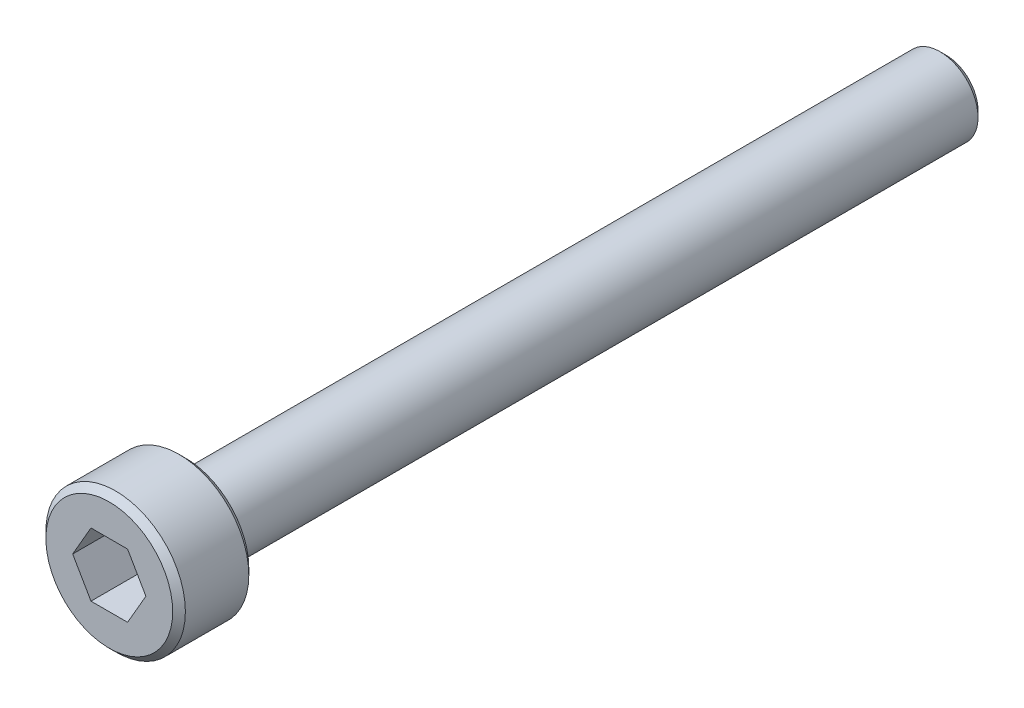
from build123d import *

# Parameters (mm, degrees)
SKETCH1_R           = 1.5
BOSS_EXTRUDE1_DEPTH = 30
SKETCH2_R           = 2.75
BOSS_EXTRUDE2_DEPTH = 3
CHAMFER1_SIZE       = 0.25
CUT_EXTRUDE1_DEPTH  = 2


with BuildPart() as part:
    # Sketch1 → Boss-Extrude1 (new body)
    with BuildSketch(Plane(origin=(0, 0, 0), x_dir=(0, 1, 0), z_dir=(0, 0, 1))):
        with Locations(Location((0, 0, 0), (0, 0, 270))):
            Circle(SKETCH1_R)
    extrude(amount=BOSS_EXTRUDE1_DEPTH)

    # Sketch2 → Boss-Extrude2 (add)
    with BuildSketch(Plane.XY.offset(30)):
        Circle(SKETCH2_R)
    extrude(amount=BOSS_EXTRUDE2_DEPTH)

    # Chamfer1
    chamfer1_edges = [part.edges().sort_by_distance(p)[0] for p in [
        (-1.5, 0, 0),
        (-2.75, 0, 30),
        (-2.75, 0, 33),
    ]]
    chamfer(chamfer1_edges, length=CHAMFER1_SIZE)

    # Sketch3 → Cut-Extrude1 (cut)
    with BuildSketch(Plane.XY.offset(33)):
        Polygon((1.443375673, 0), (0.721687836, 1.25), (-0.721687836, 1.25), (-1.443375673, 0), (-0.721687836, -1.25), (0.721687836, -1.25), align=None)
    extrude(amount=-CUT_EXTRUDE1_DEPTH, mode=Mode.SUBTRACT)


solid = part.part
